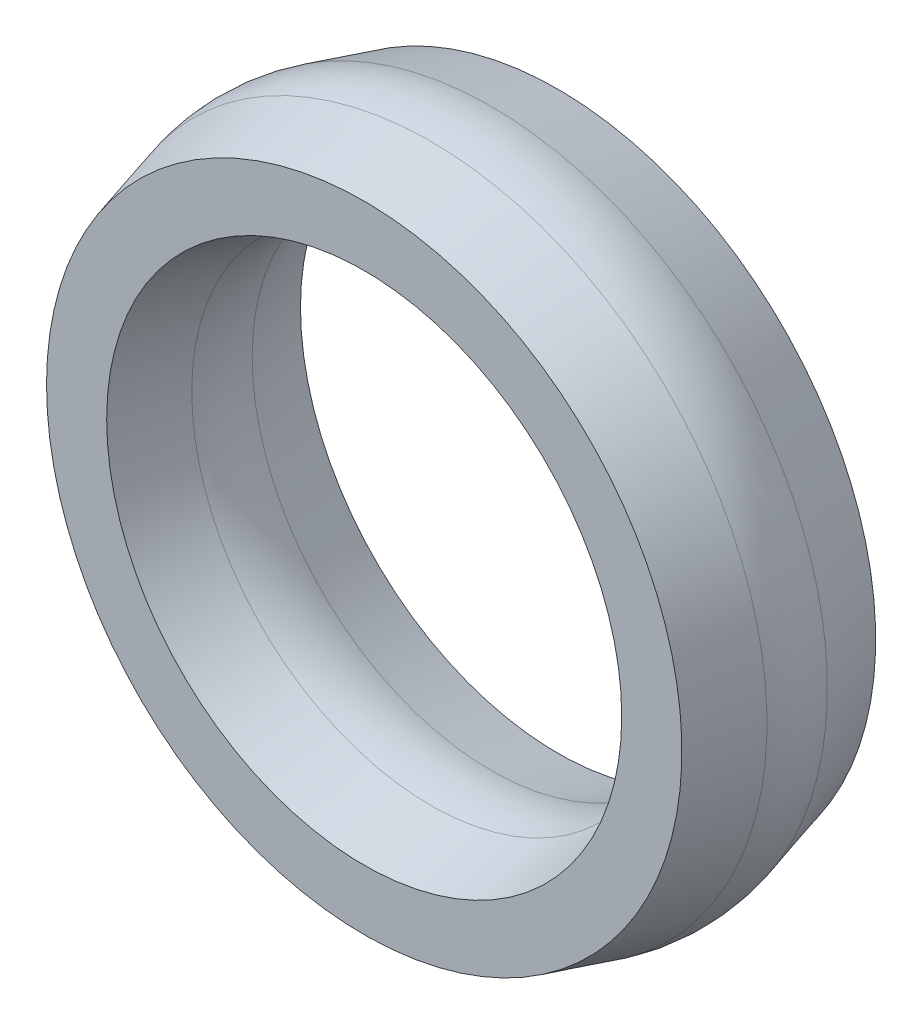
from build123d import *


with BuildPart() as part:
    # Sketch1 → Body (revolve)
    with BuildSketch(Plane(origin=(0, 0, 0), x_dir=(-1, 0, 0), z_dir=(0, 1, 0)), mode=Mode.PRIVATE) as body_sk:
        with BuildLine():
            Line((-23.767494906, 0), (-19.267494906, 0))
            Line((-19.267494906, 0), (-17.891052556, -4.989603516))
            ThreePointArc((-17.891052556, -4.989603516), (-17.584989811, -7.25), (-17.891052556, -9.510396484))
            Line((-17.891052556, -9.510396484), (-19.267494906, -14.5))
            Line((-19.267494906, -14.5), (-23.767494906, -14.5))
            Line((-23.767494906, -14.5), (-25.143937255, -9.510396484))
            ThreePointArc((-25.143937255, -9.510396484), (-25.45, -7.25), (-25.143937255, -4.989603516))
            Line((-25.143937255, -4.989603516), (-23.767494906, 0))
        make_face()
    revolve(body_sk.sketch.rotate(Axis((0, 0, -7.25), (0, 0, 1)), 180), axis=Axis((0, 0, -7.25), (0, 0, 1)))


solid = part.part
